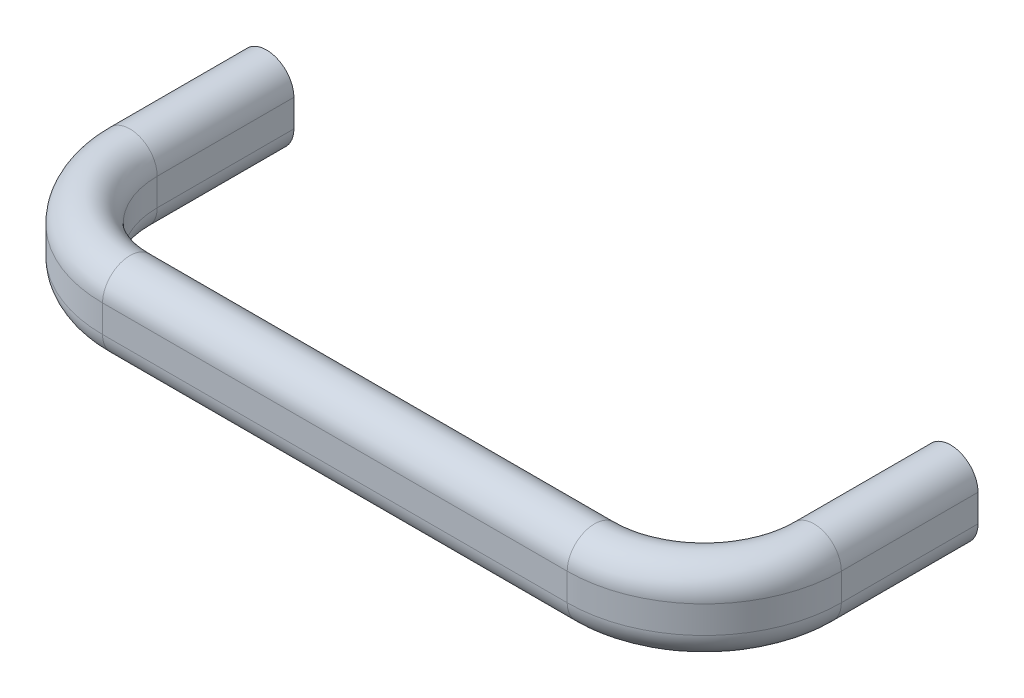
ISO-10303-21;
HEADER;
FILE_DESCRIPTION(('STEP AP214'),'2;1');
FILE_NAME('part.step','',(''),(''),'','','');
FILE_SCHEMA(('AUTOMOTIVE_DESIGN { 1 0 10303 214 1 1 1 1 }'));
ENDSEC;
DATA;
#1=APPLICATION_CONTEXT('core data for automotive mechanical design processes');
#2=APPLICATION_PROTOCOL_DEFINITION('international standard','automotive_design',2000,#1);
#3=PRODUCT_CONTEXT('',#1,'mechanical');
#4=PRODUCT('Part','Part','',(#3));
#5=PRODUCT_RELATED_PRODUCT_CATEGORY('part','',(#4));
#6=PRODUCT_DEFINITION_FORMATION('','',#4);
#7=PRODUCT_DEFINITION_CONTEXT('part definition',#1,'design');
#8=PRODUCT_DEFINITION('design','',#6,#7);
#9=PRODUCT_DEFINITION_SHAPE('','',#8);
#10=(LENGTH_UNIT() NAMED_UNIT(*) SI_UNIT(.MILLI.,.METRE.));
#11=(NAMED_UNIT(*) PLANE_ANGLE_UNIT() SI_UNIT($,.RADIAN.));
#12=(NAMED_UNIT(*) SI_UNIT($,.STERADIAN.) SOLID_ANGLE_UNIT());
#13=UNCERTAINTY_MEASURE_WITH_UNIT(LENGTH_MEASURE(1.E-05),#10,'distance_accuracy_value','');
#14=(GEOMETRIC_REPRESENTATION_CONTEXT(3) GLOBAL_UNCERTAINTY_ASSIGNED_CONTEXT((#13)) GLOBAL_UNIT_ASSIGNED_CONTEXT((#10,
#11,#12)) REPRESENTATION_CONTEXT('',''));
#15=CARTESIAN_POINT('',(0.,0.,0.));
#16=DIRECTION('',(0.,0.,1.));
#17=DIRECTION('',(1.,0.,0.));
#18=AXIS2_PLACEMENT_3D('',#15,#16,#17);
#19=CARTESIAN_POINT('',(-0.0622931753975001,1.96859057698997,0.));
#20=DIRECTION('',(0.,0.,-1.));
#21=DIRECTION('',(0.,1.,0.));
#22=AXIS2_PLACEMENT_3D('',#19,#20,#21);
#23=PLANE('',#22);
#24=CARTESIAN_POINT('',(-0.0622931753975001,1.96859057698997,0.));
#25=DIRECTION('',(0.,0.,-1.));
#26=DIRECTION('',(0.,1.,0.));
#27=AXIS2_PLACEMENT_3D('',#24,#25,#26);
#28=CIRCLE('',#27,4.);
#29=CARTESIAN_POINT('',(-4.0622931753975,1.96859057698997,0.));
#30=VERTEX_POINT('',#29);
#31=CARTESIAN_POINT('',(3.93770682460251,1.96859057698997,0.));
#32=VERTEX_POINT('',#31);
#33=EDGE_CURVE('E31',#30,#32,#28,.T.);
#34=ORIENTED_EDGE('',*,*,#33,.T.);
#35=DIRECTION('',(0.,-1.,0.));
#36=VECTOR('',#35,1.);
#37=CARTESIAN_POINT('',(3.93770682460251,1.96859057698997,0.));
#38=LINE('',#37,#36);
#39=CARTESIAN_POINT('',(3.93770682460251,-2.03140942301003,0.));
#40=VERTEX_POINT('',#39);
#41=EDGE_CURVE('E18',#32,#40,#38,.T.);
#42=ORIENTED_EDGE('',*,*,#41,.T.);
#43=CARTESIAN_POINT('',(-0.0622931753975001,-2.03140942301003,0.));
#44=DIRECTION('',(0.,0.,-1.));
#45=DIRECTION('',(0.,1.,0.));
#46=AXIS2_PLACEMENT_3D('',#43,#44,#45);
#47=CIRCLE('',#46,4.);
#48=CARTESIAN_POINT('',(-4.0622931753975,-2.03140942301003,0.));
#49=VERTEX_POINT('',#48);
#50=EDGE_CURVE('E39',#40,#49,#47,.T.);
#51=ORIENTED_EDGE('',*,*,#50,.T.);
#52=DIRECTION('',(0.,-1.,0.));
#53=VECTOR('',#52,1.);
#54=CARTESIAN_POINT('',(-4.0622931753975,1.96859057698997,0.));
#55=LINE('',#54,#53);
#56=EDGE_CURVE('E230',#30,#49,#55,.T.);
#57=ORIENTED_EDGE('',*,*,#56,.F.);
#58=EDGE_LOOP('',(#34,#42,#51,#57));
#59=FACE_BOUND('',#58,.T.);
#60=CARTESIAN_POINT('',(0.,0.,-2.25392079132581E-13));
#61=DIRECTION('',(0.,0.,-1.));
#62=DIRECTION('',(-1.,0.,0.));
#63=AXIS2_PLACEMENT_3D('',#60,#61,#62);
#64=CIRCLE('',#63,2.96700000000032);
#65=CARTESIAN_POINT('',(-2.96700000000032,0.,-2.26701545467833E-13));
#66=VERTEX_POINT('',#65);
#67=EDGE_CURVE('E542',#66,#66,#64,.T.);
#68=ORIENTED_EDGE('',*,*,#67,.F.);
#69=EDGE_LOOP('',(#68));
#70=FACE_BOUND('',#69,.T.);
#71=ADVANCED_FACE('F14',(#59,#70),#23,.T.);
#72=CARTESIAN_POINT('',(100.062293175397,1.96859057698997,0.));
#73=DIRECTION('',(0.,0.,1.));
#74=DIRECTION('',(0.,1.,0.));
#75=AXIS2_PLACEMENT_3D('',#72,#73,#74);
#76=PLANE('',#75);
#77=CARTESIAN_POINT('',(100.062293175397,1.96859057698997,0.));
#78=DIRECTION('',(0.,0.,1.));
#79=DIRECTION('',(0.,1.,0.));
#80=AXIS2_PLACEMENT_3D('',#77,#78,#79);
#81=CIRCLE('',#80,4.);
#82=CARTESIAN_POINT('',(104.062293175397,1.96859057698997,0.));
#83=VERTEX_POINT('',#82);
#84=CARTESIAN_POINT('',(96.0622931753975,1.96859057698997,0.));
#85=VERTEX_POINT('',#84);
#86=EDGE_CURVE('E107',#83,#85,#81,.T.);
#87=ORIENTED_EDGE('',*,*,#86,.F.);
#88=DIRECTION('',(0.,-1.,0.));
#89=VECTOR('',#88,1.);
#90=CARTESIAN_POINT('',(104.062293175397,1.96859057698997,0.));
#91=LINE('',#90,#89);
#92=CARTESIAN_POINT('',(104.062293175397,-2.03140942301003,0.));
#93=VERTEX_POINT('',#92);
#94=EDGE_CURVE('E136',#83,#93,#91,.T.);
#95=ORIENTED_EDGE('',*,*,#94,.T.);
#96=CARTESIAN_POINT('',(100.062293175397,-2.03140942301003,0.));
#97=DIRECTION('',(0.,0.,1.));
#98=DIRECTION('',(0.,1.,0.));
#99=AXIS2_PLACEMENT_3D('',#96,#97,#98);
#100=CIRCLE('',#99,4.);
#101=CARTESIAN_POINT('',(96.0622931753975,-2.03140942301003,0.));
#102=VERTEX_POINT('',#101);
#103=EDGE_CURVE('E134',#102,#93,#100,.T.);
#104=ORIENTED_EDGE('',*,*,#103,.F.);
#105=DIRECTION('',(0.,-1.,0.));
#106=VECTOR('',#105,1.);
#107=CARTESIAN_POINT('',(96.0622931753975,1.96859057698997,0.));
#108=LINE('',#107,#106);
#109=EDGE_CURVE('E119',#85,#102,#108,.T.);
#110=ORIENTED_EDGE('',*,*,#109,.F.);
#111=EDGE_LOOP('',(#87,#95,#104,#110));
#112=FACE_BOUND('',#111,.T.);
#113=CARTESIAN_POINT('',(100.,0.,-1.52603933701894E-13));
#114=DIRECTION('',(0.,0.,1.));
#115=DIRECTION('',(1.,0.,0.));
#116=AXIS2_PLACEMENT_3D('',#113,#114,#115);
#117=CIRCLE('',#116,2.96700000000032);
#118=CARTESIAN_POINT('',(102.967,0.,-1.49594151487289E-13));
#119=VERTEX_POINT('',#118);
#120=EDGE_CURVE('E120',#119,#119,#117,.T.);
#121=ORIENTED_EDGE('',*,*,#120,.T.);
#122=EDGE_LOOP('',(#121));
#123=FACE_BOUND('',#122,.T.);
#124=ADVANCED_FACE('F132',(#112,#123),#76,.F.);
#125=CARTESIAN_POINT('',(3.93770682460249,1.96859057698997,20.));
#126=DIRECTION('',(1.,0.,0.));
#127=DIRECTION('',(0.,1.,0.));
#128=AXIS2_PLACEMENT_3D('',#125,#126,#127);
#129=PLANE('',#128);
#130=DIRECTION('',(0.,-1.,0.));
#131=VECTOR('',#130,1.);
#132=CARTESIAN_POINT('',(3.93770682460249,1.96859057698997,20.));
#133=LINE('',#132,#131);
#134=CARTESIAN_POINT('',(3.93770682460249,1.96859057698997,20.));
#135=VERTEX_POINT('',#134);
#136=CARTESIAN_POINT('',(3.93770682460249,-2.03140942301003,20.));
#137=VERTEX_POINT('',#136);
#138=EDGE_CURVE('E204',#135,#137,#133,.T.);
#139=ORIENTED_EDGE('',*,*,#138,.T.);
#140=DIRECTION('',(0.,0.,-1.));
#141=VECTOR('',#140,1.);
#142=CARTESIAN_POINT('',(3.93770682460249,-2.03140942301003,20.));
#143=LINE('',#142,#141);
#144=EDGE_CURVE('E23',#137,#40,#143,.T.);
#145=ORIENTED_EDGE('',*,*,#144,.T.);
#146=ORIENTED_EDGE('',*,*,#41,.F.);
#147=DIRECTION('',(0.,0.,-1.));
#148=VECTOR('',#147,1.);
#149=CARTESIAN_POINT('',(3.93770682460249,1.96859057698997,20.));
#150=LINE('',#149,#148);
#151=EDGE_CURVE('E9',#135,#32,#150,.T.);
#152=ORIENTED_EDGE('',*,*,#151,.F.);
#153=EDGE_LOOP('',(#139,#145,#146,#152));
#154=FACE_BOUND('',#153,.T.);
#155=ADVANCED_FACE('F16',(#154),#129,.T.);
#156=CARTESIAN_POINT('',(-0.0622931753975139,-2.03140942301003,20.));
#157=DIRECTION('',(0.,0.,-1.));
#158=DIRECTION('',(0.,-1.,0.));
#159=AXIS2_PLACEMENT_3D('',#156,#157,#158);
#160=CYLINDRICAL_SURFACE('',#159,4.);
#161=CARTESIAN_POINT('',(-0.0622931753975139,-2.03140942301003,20.));
#162=DIRECTION('',(0.,0.,-1.));
#163=DIRECTION('',(0.,1.,0.));
#164=AXIS2_PLACEMENT_3D('',#161,#162,#163);
#165=CIRCLE('',#164,4.);
#166=CARTESIAN_POINT('',(-4.06229317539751,-2.03140942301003,20.));
#167=VERTEX_POINT('',#166);
#168=EDGE_CURVE('E217',#137,#167,#165,.T.);
#169=ORIENTED_EDGE('',*,*,#168,.T.);
#170=DIRECTION('',(0.,0.,-1.));
#171=VECTOR('',#170,1.);
#172=CARTESIAN_POINT('',(-4.06229317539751,-2.03140942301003,20.));
#173=LINE('',#172,#171);
#174=EDGE_CURVE('E225',#167,#49,#173,.T.);
#175=ORIENTED_EDGE('',*,*,#174,.T.);
#176=ORIENTED_EDGE('',*,*,#50,.F.);
#177=ORIENTED_EDGE('',*,*,#144,.F.);
#178=EDGE_LOOP('',(#169,#175,#176,#177));
#179=FACE_BOUND('',#178,.T.);
#180=ADVANCED_FACE('F235',(#179),#160,.T.);
#181=CARTESIAN_POINT('',(-4.06229317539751,1.96859057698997,20.));
#182=DIRECTION('',(1.,0.,0.));
#183=DIRECTION('',(0.,1.,0.));
#184=AXIS2_PLACEMENT_3D('',#181,#182,#183);
#185=PLANE('',#184);
#186=DIRECTION('',(0.,-1.,0.));
#187=VECTOR('',#186,1.);
#188=CARTESIAN_POINT('',(-4.06229317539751,1.96859057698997,20.));
#189=LINE('',#188,#187);
#190=CARTESIAN_POINT('',(-4.06229317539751,1.96859057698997,20.));
#191=VERTEX_POINT('',#190);
#192=EDGE_CURVE('E214',#191,#167,#189,.T.);
#193=ORIENTED_EDGE('',*,*,#192,.F.);
#194=DIRECTION('',(0.,0.,-1.));
#195=VECTOR('',#194,1.);
#196=CARTESIAN_POINT('',(-4.06229317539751,1.96859057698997,20.));
#197=LINE('',#196,#195);
#198=EDGE_CURVE('E222',#191,#30,#197,.T.);
#199=ORIENTED_EDGE('',*,*,#198,.T.);
#200=ORIENTED_EDGE('',*,*,#56,.T.);
#201=ORIENTED_EDGE('',*,*,#174,.F.);
#202=EDGE_LOOP('',(#193,#199,#200,#201));
#203=FACE_BOUND('',#202,.T.);
#204=ADVANCED_FACE('F292',(#203),#185,.F.);
#205=CARTESIAN_POINT('',(-0.0622931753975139,1.96859057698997,20.));
#206=DIRECTION('',(0.,0.,-1.));
#207=DIRECTION('',(0.,-1.,0.));
#208=AXIS2_PLACEMENT_3D('',#205,#206,#207);
#209=CYLINDRICAL_SURFACE('',#208,4.);
#210=CARTESIAN_POINT('',(-0.0622931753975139,1.96859057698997,20.));
#211=DIRECTION('',(0.,0.,-1.));
#212=DIRECTION('',(0.,1.,0.));
#213=AXIS2_PLACEMENT_3D('',#210,#211,#212);
#214=CIRCLE('',#213,4.);
#215=EDGE_CURVE('E190',#191,#135,#214,.T.);
#216=ORIENTED_EDGE('',*,*,#215,.T.);
#217=ORIENTED_EDGE('',*,*,#151,.T.);
#218=ORIENTED_EDGE('',*,*,#33,.F.);
#219=ORIENTED_EDGE('',*,*,#198,.F.);
#220=EDGE_LOOP('',(#216,#217,#218,#219));
#221=FACE_BOUND('',#220,.T.);
#222=ADVANCED_FACE('F283',(#221),#209,.T.);
#223=CARTESIAN_POINT('',(16.,0.,20.));
#224=DIRECTION('',(0.,-1.,0.));
#225=DIRECTION('',(1.,0.,0.));
#226=AXIS2_PLACEMENT_3D('',#223,#224,#225);
#227=CYLINDRICAL_SURFACE('',#226,12.0622931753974);
#228=DIRECTION('',(0.,-1.,0.));
#229=VECTOR('',#228,1.);
#230=CARTESIAN_POINT('',(16.,1.96859057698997,32.0622931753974));
#231=LINE('',#230,#229);
#232=CARTESIAN_POINT('',(16.,1.96859057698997,32.0622931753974));
#233=VERTEX_POINT('',#232);
#234=CARTESIAN_POINT('',(16.,-2.03140942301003,32.0622931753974));
#235=VERTEX_POINT('',#234);
#236=EDGE_CURVE('E181',#233,#235,#231,.T.);
#237=ORIENTED_EDGE('',*,*,#236,.T.);
#238=CARTESIAN_POINT('',(16.,-2.03140942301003,20.));
#239=DIRECTION('',(0.,-1.,0.));
#240=DIRECTION('',(1.,0.,0.));
#241=AXIS2_PLACEMENT_3D('',#238,#239,#240);
#242=CIRCLE('',#241,12.0622931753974);
#243=EDGE_CURVE('E207',#235,#137,#242,.T.);
#244=ORIENTED_EDGE('',*,*,#243,.T.);
#245=ORIENTED_EDGE('',*,*,#138,.F.);
#246=CARTESIAN_POINT('',(16.,1.96859057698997,20.));
#247=DIRECTION('',(0.,-1.,0.));
#248=DIRECTION('',(1.,0.,0.));
#249=AXIS2_PLACEMENT_3D('',#246,#247,#248);
#250=CIRCLE('',#249,12.0622931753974);
#251=EDGE_CURVE('E210',#233,#135,#250,.T.);
#252=ORIENTED_EDGE('',*,*,#251,.F.);
#253=EDGE_LOOP('',(#237,#244,#245,#252));
#254=FACE_BOUND('',#253,.T.);
#255=ADVANCED_FACE('F281',(#254),#227,.F.);
#256=CARTESIAN_POINT('',(16.,-2.03140942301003,20.));
#257=DIRECTION('',(0.,-1.,0.));
#258=DIRECTION('',(1.,0.,0.));
#259=AXIS2_PLACEMENT_3D('',#256,#257,#258);
#260=TOROIDAL_SURFACE('',#259,16.0622931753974,4.);
#261=CARTESIAN_POINT('',(16.,-2.03140942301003,36.0622931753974));
#262=DIRECTION('',(-1.,0.,0.));
#263=DIRECTION('',(0.,1.,0.));
#264=AXIS2_PLACEMENT_3D('',#261,#262,#263);
#265=CIRCLE('',#264,4.);
#266=CARTESIAN_POINT('',(16.,-2.03140942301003,40.0622931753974));
#267=VERTEX_POINT('',#266);
#268=EDGE_CURVE('E195',#235,#267,#265,.T.);
#269=ORIENTED_EDGE('',*,*,#268,.T.);
#270=CARTESIAN_POINT('',(16.,-2.03140942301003,20.));
#271=DIRECTION('',(0.,-1.,0.));
#272=DIRECTION('',(1.,0.,0.));
#273=AXIS2_PLACEMENT_3D('',#270,#271,#272);
#274=CIRCLE('',#273,20.0622931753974);
#275=EDGE_CURVE('E203',#267,#167,#274,.T.);
#276=ORIENTED_EDGE('',*,*,#275,.T.);
#277=ORIENTED_EDGE('',*,*,#168,.F.);
#278=ORIENTED_EDGE('',*,*,#243,.F.);
#279=EDGE_LOOP('',(#269,#276,#277,#278));
#280=FACE_BOUND('',#279,.T.);
#281=ADVANCED_FACE('F244',(#280),#260,.T.);
#282=CARTESIAN_POINT('',(16.,0.,20.));
#283=DIRECTION('',(0.,-1.,0.));
#284=DIRECTION('',(1.,0.,0.));
#285=AXIS2_PLACEMENT_3D('',#282,#283,#284);
#286=CYLINDRICAL_SURFACE('',#285,20.0622931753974);
#287=DIRECTION('',(0.,-1.,0.));
#288=VECTOR('',#287,1.);
#289=CARTESIAN_POINT('',(16.,1.96859057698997,40.0622931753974));
#290=LINE('',#289,#288);
#291=CARTESIAN_POINT('',(16.,1.96859057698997,40.0622931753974));
#292=VERTEX_POINT('',#291);
#293=EDGE_CURVE('E192',#292,#267,#290,.T.);
#294=ORIENTED_EDGE('',*,*,#293,.F.);
#295=CARTESIAN_POINT('',(16.,1.96859057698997,20.));
#296=DIRECTION('',(0.,-1.,0.));
#297=DIRECTION('',(1.,0.,0.));
#298=AXIS2_PLACEMENT_3D('',#295,#296,#297);
#299=CIRCLE('',#298,20.0622931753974);
#300=EDGE_CURVE('E200',#292,#191,#299,.T.);
#301=ORIENTED_EDGE('',*,*,#300,.T.);
#302=ORIENTED_EDGE('',*,*,#192,.T.);
#303=ORIENTED_EDGE('',*,*,#275,.F.);
#304=EDGE_LOOP('',(#294,#301,#302,#303));
#305=FACE_BOUND('',#304,.T.);
#306=ADVANCED_FACE('F241',(#305),#286,.T.);
#307=CARTESIAN_POINT('',(16.,1.96859057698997,20.));
#308=DIRECTION('',(0.,-1.,0.));
#309=DIRECTION('',(1.,0.,0.));
#310=AXIS2_PLACEMENT_3D('',#307,#308,#309);
#311=TOROIDAL_SURFACE('',#310,16.0622931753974,4.);
#312=CARTESIAN_POINT('',(16.,1.96859057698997,36.0622931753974));
#313=DIRECTION('',(-1.,0.,0.));
#314=DIRECTION('',(0.,1.,0.));
#315=AXIS2_PLACEMENT_3D('',#312,#313,#314);
#316=CIRCLE('',#315,4.);
#317=EDGE_CURVE('E167',#292,#233,#316,.T.);
#318=ORIENTED_EDGE('',*,*,#317,.T.);
#319=ORIENTED_EDGE('',*,*,#251,.T.);
#320=ORIENTED_EDGE('',*,*,#215,.F.);
#321=ORIENTED_EDGE('',*,*,#300,.F.);
#322=EDGE_LOOP('',(#318,#319,#320,#321));
#323=FACE_BOUND('',#322,.T.);
#324=ADVANCED_FACE('F279',(#323),#311,.T.);
#325=CARTESIAN_POINT('',(84.,1.96859057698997,32.0622931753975));
#326=DIRECTION('',(0.,0.,-1.));
#327=DIRECTION('',(-1.,0.,0.));
#328=AXIS2_PLACEMENT_3D('',#325,#326,#327);
#329=PLANE('',#328);
#330=DIRECTION('',(0.,-1.,0.));
#331=VECTOR('',#330,1.);
#332=CARTESIAN_POINT('',(84.,1.96859057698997,32.0622931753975));
#333=LINE('',#332,#331);
#334=CARTESIAN_POINT('',(84.,1.96859057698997,32.0622931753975));
#335=VERTEX_POINT('',#334);
#336=CARTESIAN_POINT('',(84.,-2.03140942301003,32.0622931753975));
#337=VERTEX_POINT('',#336);
#338=EDGE_CURVE('E158',#335,#337,#333,.T.);
#339=ORIENTED_EDGE('',*,*,#338,.T.);
#340=DIRECTION('',(-1.,0.,0.));
#341=VECTOR('',#340,1.);
#342=CARTESIAN_POINT('',(84.,-2.03140942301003,32.0622931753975));
#343=LINE('',#342,#341);
#344=EDGE_CURVE('E184',#337,#235,#343,.T.);
#345=ORIENTED_EDGE('',*,*,#344,.T.);
#346=ORIENTED_EDGE('',*,*,#236,.F.);
#347=DIRECTION('',(-1.,0.,0.));
#348=VECTOR('',#347,1.);
#349=CARTESIAN_POINT('',(84.,1.96859057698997,32.0622931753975));
#350=LINE('',#349,#348);
#351=EDGE_CURVE('E187',#335,#233,#350,.T.);
#352=ORIENTED_EDGE('',*,*,#351,.F.);
#353=EDGE_LOOP('',(#339,#345,#346,#352));
#354=FACE_BOUND('',#353,.T.);
#355=ADVANCED_FACE('F273',(#354),#329,.T.);
#356=CARTESIAN_POINT('',(84.,-2.03140942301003,36.0622931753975));
#357=DIRECTION('',(-1.,0.,0.));
#358=DIRECTION('',(0.,0.,1.));
#359=AXIS2_PLACEMENT_3D('',#356,#357,#358);
#360=CYLINDRICAL_SURFACE('',#359,4.);
#361=CARTESIAN_POINT('',(84.,-2.03140942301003,36.0622931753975));
#362=DIRECTION('',(-1.,0.,0.));
#363=DIRECTION('',(0.,1.,0.));
#364=AXIS2_PLACEMENT_3D('',#361,#362,#363);
#365=CIRCLE('',#364,4.);
#366=CARTESIAN_POINT('',(84.,-2.03140942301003,40.0622931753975));
#367=VERTEX_POINT('',#366);
#368=EDGE_CURVE('E172',#337,#367,#365,.T.);
#369=ORIENTED_EDGE('',*,*,#368,.T.);
#370=DIRECTION('',(-1.,0.,0.));
#371=VECTOR('',#370,1.);
#372=CARTESIAN_POINT('',(84.,-2.03140942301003,40.0622931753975));
#373=LINE('',#372,#371);
#374=EDGE_CURVE('E180',#367,#267,#373,.T.);
#375=ORIENTED_EDGE('',*,*,#374,.T.);
#376=ORIENTED_EDGE('',*,*,#268,.F.);
#377=ORIENTED_EDGE('',*,*,#344,.F.);
#378=EDGE_LOOP('',(#369,#375,#376,#377));
#379=FACE_BOUND('',#378,.T.);
#380=ADVANCED_FACE('F251',(#379),#360,.T.);
#381=CARTESIAN_POINT('',(84.,1.96859057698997,40.0622931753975));
#382=DIRECTION('',(0.,0.,-1.));
#383=DIRECTION('',(-1.,0.,0.));
#384=AXIS2_PLACEMENT_3D('',#381,#382,#383);
#385=PLANE('',#384);
#386=DIRECTION('',(0.,-1.,0.));
#387=VECTOR('',#386,1.);
#388=CARTESIAN_POINT('',(84.,1.96859057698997,40.0622931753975));
#389=LINE('',#388,#387);
#390=CARTESIAN_POINT('',(84.,1.96859057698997,40.0622931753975));
#391=VERTEX_POINT('',#390);
#392=EDGE_CURVE('E169',#391,#367,#389,.T.);
#393=ORIENTED_EDGE('',*,*,#392,.F.);
#394=DIRECTION('',(-1.,0.,0.));
#395=VECTOR('',#394,1.);
#396=CARTESIAN_POINT('',(84.,1.96859057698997,40.0622931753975));
#397=LINE('',#396,#395);
#398=EDGE_CURVE('E177',#391,#292,#397,.T.);
#399=ORIENTED_EDGE('',*,*,#398,.T.);
#400=ORIENTED_EDGE('',*,*,#293,.T.);
#401=ORIENTED_EDGE('',*,*,#374,.F.);
#402=EDGE_LOOP('',(#393,#399,#400,#401));
#403=FACE_BOUND('',#402,.T.);
#404=ADVANCED_FACE('F249',(#403),#385,.F.);
#405=CARTESIAN_POINT('',(84.,1.96859057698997,36.0622931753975));
#406=DIRECTION('',(-1.,0.,0.));
#407=DIRECTION('',(0.,0.,1.));
#408=AXIS2_PLACEMENT_3D('',#405,#406,#407);
#409=CYLINDRICAL_SURFACE('',#408,4.);
#410=CARTESIAN_POINT('',(84.,1.96859057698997,36.0622931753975));
#411=DIRECTION('',(-1.,0.,0.));
#412=DIRECTION('',(0.,1.,0.));
#413=AXIS2_PLACEMENT_3D('',#410,#411,#412);
#414=CIRCLE('',#413,4.);
#415=EDGE_CURVE('E129',#391,#335,#414,.T.);
#416=ORIENTED_EDGE('',*,*,#415,.T.);
#417=ORIENTED_EDGE('',*,*,#351,.T.);
#418=ORIENTED_EDGE('',*,*,#317,.F.);
#419=ORIENTED_EDGE('',*,*,#398,.F.);
#420=EDGE_LOOP('',(#416,#417,#418,#419));
#421=FACE_BOUND('',#420,.T.);
#422=ADVANCED_FACE('F276',(#421),#409,.T.);
#423=CARTESIAN_POINT('',(84.,0.,20.));
#424=DIRECTION('',(0.,-1.,0.));
#425=DIRECTION('',(1.,0.,0.));
#426=AXIS2_PLACEMENT_3D('',#423,#424,#425);
#427=CYLINDRICAL_SURFACE('',#426,12.0622931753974);
#428=DIRECTION('',(0.,-1.,0.));
#429=VECTOR('',#428,1.);
#430=CARTESIAN_POINT('',(96.0622931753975,1.96859057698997,20.));
#431=LINE('',#430,#429);
#432=CARTESIAN_POINT('',(96.0622931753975,1.96859057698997,20.));
#433=VERTEX_POINT('',#432);
#434=CARTESIAN_POINT('',(96.0622931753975,-2.03140942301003,20.));
#435=VERTEX_POINT('',#434);
#436=EDGE_CURVE('E128',#433,#435,#431,.T.);
#437=ORIENTED_EDGE('',*,*,#436,.T.);
#438=CARTESIAN_POINT('',(84.,-2.03140942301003,20.));
#439=DIRECTION('',(0.,-1.,0.));
#440=DIRECTION('',(1.,0.,0.));
#441=AXIS2_PLACEMENT_3D('',#438,#439,#440);
#442=CIRCLE('',#441,12.0622931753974);
#443=EDGE_CURVE('E161',#435,#337,#442,.T.);
#444=ORIENTED_EDGE('',*,*,#443,.T.);
#445=ORIENTED_EDGE('',*,*,#338,.F.);
#446=CARTESIAN_POINT('',(84.,1.96859057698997,20.));
#447=DIRECTION('',(0.,-1.,0.));
#448=DIRECTION('',(1.,0.,0.));
#449=AXIS2_PLACEMENT_3D('',#446,#447,#448);
#450=CIRCLE('',#449,12.0622931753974);
#451=EDGE_CURVE('E164',#433,#335,#450,.T.);
#452=ORIENTED_EDGE('',*,*,#451,.F.);
#453=EDGE_LOOP('',(#437,#444,#445,#452));
#454=FACE_BOUND('',#453,.T.);
#455=ADVANCED_FACE('F270',(#454),#427,.F.);
#456=CARTESIAN_POINT('',(84.,-2.03140942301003,20.));
#457=DIRECTION('',(0.,-1.,0.));
#458=DIRECTION('',(1.,0.,0.));
#459=AXIS2_PLACEMENT_3D('',#456,#457,#458);
#460=TOROIDAL_SURFACE('',#459,16.0622931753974,4.);
#461=CARTESIAN_POINT('',(100.062293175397,-2.03140942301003,20.));
#462=DIRECTION('',(0.,0.,1.));
#463=DIRECTION('',(0.,1.,0.));
#464=AXIS2_PLACEMENT_3D('',#461,#462,#463);
#465=CIRCLE('',#464,4.);
#466=CARTESIAN_POINT('',(104.062293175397,-2.03140942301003,20.));
#467=VERTEX_POINT('',#466);
#468=EDGE_CURVE('E144',#435,#467,#465,.T.);
#469=ORIENTED_EDGE('',*,*,#468,.T.);
#470=CARTESIAN_POINT('',(84.,-2.03140942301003,20.));
#471=DIRECTION('',(0.,-1.,0.));
#472=DIRECTION('',(1.,0.,0.));
#473=AXIS2_PLACEMENT_3D('',#470,#471,#472);
#474=CIRCLE('',#473,20.0622931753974);
#475=EDGE_CURVE('E157',#467,#367,#474,.T.);
#476=ORIENTED_EDGE('',*,*,#475,.T.);
#477=ORIENTED_EDGE('',*,*,#368,.F.);
#478=ORIENTED_EDGE('',*,*,#443,.F.);
#479=EDGE_LOOP('',(#469,#476,#477,#478));
#480=FACE_BOUND('',#479,.T.);
#481=ADVANCED_FACE('F259',(#480),#460,.T.);
#482=CARTESIAN_POINT('',(84.,0.,20.));
#483=DIRECTION('',(0.,-1.,0.));
#484=DIRECTION('',(1.,0.,0.));
#485=AXIS2_PLACEMENT_3D('',#482,#483,#484);
#486=CYLINDRICAL_SURFACE('',#485,20.0622931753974);
#487=DIRECTION('',(0.,-1.,0.));
#488=VECTOR('',#487,1.);
#489=CARTESIAN_POINT('',(104.062293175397,1.96859057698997,20.));
#490=LINE('',#489,#488);
#491=CARTESIAN_POINT('',(104.062293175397,1.96859057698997,20.));
#492=VERTEX_POINT('',#491);
#493=EDGE_CURVE('E146',#492,#467,#490,.T.);
#494=ORIENTED_EDGE('',*,*,#493,.F.);
#495=CARTESIAN_POINT('',(84.,1.96859057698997,20.));
#496=DIRECTION('',(0.,-1.,0.));
#497=DIRECTION('',(1.,0.,0.));
#498=AXIS2_PLACEMENT_3D('',#495,#496,#497);
#499=CIRCLE('',#498,20.0622931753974);
#500=EDGE_CURVE('E154',#492,#391,#499,.T.);
#501=ORIENTED_EDGE('',*,*,#500,.T.);
#502=ORIENTED_EDGE('',*,*,#392,.T.);
#503=ORIENTED_EDGE('',*,*,#475,.F.);
#504=EDGE_LOOP('',(#494,#501,#502,#503));
#505=FACE_BOUND('',#504,.T.);
#506=ADVANCED_FACE('F256',(#505),#486,.T.);
#507=CARTESIAN_POINT('',(84.,1.96859057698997,20.));
#508=DIRECTION('',(0.,-1.,0.));
#509=DIRECTION('',(1.,0.,0.));
#510=AXIS2_PLACEMENT_3D('',#507,#508,#509);
#511=TOROIDAL_SURFACE('',#510,16.0622931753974,4.);
#512=CARTESIAN_POINT('',(100.062293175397,1.96859057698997,20.));
#513=DIRECTION('',(0.,0.,1.));
#514=DIRECTION('',(0.,1.,0.));
#515=AXIS2_PLACEMENT_3D('',#512,#513,#514);
#516=CIRCLE('',#515,4.);
#517=EDGE_CURVE('E141',#492,#433,#516,.T.);
#518=ORIENTED_EDGE('',*,*,#517,.T.);
#519=ORIENTED_EDGE('',*,*,#451,.T.);
#520=ORIENTED_EDGE('',*,*,#415,.F.);
#521=ORIENTED_EDGE('',*,*,#500,.F.);
#522=EDGE_LOOP('',(#518,#519,#520,#521));
#523=FACE_BOUND('',#522,.T.);
#524=ADVANCED_FACE('F267',(#523),#511,.T.);
#525=CARTESIAN_POINT('',(100.062293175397,1.96859057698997,20.));
#526=DIRECTION('',(0.,0.,-1.));
#527=DIRECTION('',(0.,-1.,0.));
#528=AXIS2_PLACEMENT_3D('',#525,#526,#527);
#529=CYLINDRICAL_SURFACE('',#528,4.);
#530=DIRECTION('',(0.,0.,-1.));
#531=VECTOR('',#530,1.);
#532=CARTESIAN_POINT('',(96.0622931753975,1.96859057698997,20.));
#533=LINE('',#532,#531);
#534=EDGE_CURVE('E111',#433,#85,#533,.T.);
#535=ORIENTED_EDGE('',*,*,#534,.F.);
#536=ORIENTED_EDGE('',*,*,#517,.F.);
#537=DIRECTION('',(0.,0.,-1.));
#538=VECTOR('',#537,1.);
#539=CARTESIAN_POINT('',(104.062293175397,1.96859057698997,20.));
#540=LINE('',#539,#538);
#541=EDGE_CURVE('E114',#492,#83,#540,.T.);
#542=ORIENTED_EDGE('',*,*,#541,.T.);
#543=ORIENTED_EDGE('',*,*,#86,.T.);
#544=EDGE_LOOP('',(#535,#536,#542,#543));
#545=FACE_BOUND('',#544,.T.);
#546=ADVANCED_FACE('F109',(#545),#529,.T.);
#547=CARTESIAN_POINT('',(96.0622931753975,1.96859057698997,20.));
#548=DIRECTION('',(1.,0.,0.));
#549=DIRECTION('',(0.,1.,0.));
#550=AXIS2_PLACEMENT_3D('',#547,#548,#549);
#551=PLANE('',#550);
#552=DIRECTION('',(0.,0.,-1.));
#553=VECTOR('',#552,1.);
#554=CARTESIAN_POINT('',(96.0622931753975,-2.03140942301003,20.));
#555=LINE('',#554,#553);
#556=EDGE_CURVE('E130',#435,#102,#555,.T.);
#557=ORIENTED_EDGE('',*,*,#556,.F.);
#558=ORIENTED_EDGE('',*,*,#436,.F.);
#559=ORIENTED_EDGE('',*,*,#534,.T.);
#560=ORIENTED_EDGE('',*,*,#109,.T.);
#561=EDGE_LOOP('',(#557,#558,#559,#560));
#562=FACE_BOUND('',#561,.T.);
#563=ADVANCED_FACE('F125',(#562),#551,.F.);
#564=CARTESIAN_POINT('',(100.062293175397,-2.03140942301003,20.));
#565=DIRECTION('',(0.,0.,-1.));
#566=DIRECTION('',(0.,-1.,0.));
#567=AXIS2_PLACEMENT_3D('',#564,#565,#566);
#568=CYLINDRICAL_SURFACE('',#567,4.);
#569=DIRECTION('',(0.,0.,-1.));
#570=VECTOR('',#569,1.);
#571=CARTESIAN_POINT('',(104.062293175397,-2.03140942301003,20.));
#572=LINE('',#571,#570);
#573=EDGE_CURVE('E150',#467,#93,#572,.T.);
#574=ORIENTED_EDGE('',*,*,#573,.F.);
#575=ORIENTED_EDGE('',*,*,#468,.F.);
#576=ORIENTED_EDGE('',*,*,#556,.T.);
#577=ORIENTED_EDGE('',*,*,#103,.T.);
#578=EDGE_LOOP('',(#574,#575,#576,#577));
#579=FACE_BOUND('',#578,.T.);
#580=ADVANCED_FACE('F262',(#579),#568,.T.);
#581=CARTESIAN_POINT('',(104.062293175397,1.96859057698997,20.));
#582=DIRECTION('',(1.,0.,0.));
#583=DIRECTION('',(0.,1.,0.));
#584=AXIS2_PLACEMENT_3D('',#581,#582,#583);
#585=PLANE('',#584);
#586=ORIENTED_EDGE('',*,*,#493,.T.);
#587=ORIENTED_EDGE('',*,*,#573,.T.);
#588=ORIENTED_EDGE('',*,*,#94,.F.);
#589=ORIENTED_EDGE('',*,*,#541,.F.);
#590=EDGE_LOOP('',(#586,#587,#588,#589));
#591=FACE_BOUND('',#590,.T.);
#592=ADVANCED_FACE('F264',(#591),#585,.T.);
#593=CARTESIAN_POINT('',(100.,0.,-1.52603933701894E-13));
#594=DIRECTION('',(0.,0.,-1.));
#595=DIRECTION('',(-1.,0.,0.));
#596=AXIS2_PLACEMENT_3D('',#593,#594,#595);
#597=CONICAL_SURFACE('',#596,2.96700000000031,0.785398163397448);
#598=CARTESIAN_POINT('',(100.,0.,0.467000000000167));
#599=DIRECTION('',(0.,0.,-1.));
#600=DIRECTION('',(-1.,0.,0.));
#601=AXIS2_PLACEMENT_3D('',#598,#599,#600);
#602=CIRCLE('',#601,2.5);
#603=CARTESIAN_POINT('',(97.5,0.,0.467000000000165));
#604=VERTEX_POINT('',#603);
#605=EDGE_CURVE('E539',#604,#604,#602,.T.);
#606=ORIENTED_EDGE('',*,*,#605,.F.);
#607=EDGE_LOOP('',(#606));
#608=FACE_BOUND('',#607,.T.);
#609=ORIENTED_EDGE('',*,*,#120,.F.);
#610=EDGE_LOOP('',(#609));
#611=FACE_BOUND('',#610,.T.);
#612=ADVANCED_FACE('F306',(#608,#611),#597,.F.);
#613=CARTESIAN_POINT('',(0.,0.,-2.25392079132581E-13));
#614=DIRECTION('',(0.,0.,-1.));
#615=DIRECTION('',(1.,0.,0.));
#616=AXIS2_PLACEMENT_3D('',#613,#614,#615);
#617=CONICAL_SURFACE('',#616,2.96700000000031,0.785398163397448);
#618=CARTESIAN_POINT('',(0.,0.,0.467000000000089));
#619=DIRECTION('',(0.,0.,-1.));
#620=DIRECTION('',(-1.,0.,0.));
#621=AXIS2_PLACEMENT_3D('',#618,#619,#620);
#622=CIRCLE('',#621,2.5);
#623=CARTESIAN_POINT('',(-2.5,0.,0.467000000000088));
#624=VERTEX_POINT('',#623);
#625=EDGE_CURVE('E531',#624,#624,#622,.T.);
#626=ORIENTED_EDGE('',*,*,#625,.F.);
#627=EDGE_LOOP('',(#626));
#628=FACE_BOUND('',#627,.T.);
#629=ORIENTED_EDGE('',*,*,#67,.T.);
#630=EDGE_LOOP('',(#629));
#631=FACE_BOUND('',#630,.T.);
#632=ADVANCED_FACE('F414',(#628,#631),#617,.F.);
#633=CARTESIAN_POINT('',(100.,0.,10.));
#634=DIRECTION('',(0.,0.,-1.));
#635=DIRECTION('',(-1.,0.,0.));
#636=AXIS2_PLACEMENT_3D('',#633,#634,#635);
#637=CYLINDRICAL_SURFACE('',#636,2.5);
#638=ORIENTED_EDGE('',*,*,#605,.T.);
#639=EDGE_LOOP('',(#638));
#640=FACE_BOUND('',#639,.T.);
#641=CARTESIAN_POINT('',(100.,0.,10.));
#642=DIRECTION('',(0.,0.,-1.));
#643=DIRECTION('',(-1.,0.,0.));
#644=AXIS2_PLACEMENT_3D('',#641,#642,#643);
#645=CIRCLE('',#644,2.5);
#646=CARTESIAN_POINT('',(97.5,0.,10.));
#647=VERTEX_POINT('',#646);
#648=EDGE_CURVE('E534',#647,#647,#645,.T.);
#649=ORIENTED_EDGE('',*,*,#648,.F.);
#650=EDGE_LOOP('',(#649));
#651=FACE_BOUND('',#650,.T.);
#652=ADVANCED_FACE('F422',(#640,#651),#637,.F.);
#653=CARTESIAN_POINT('',(100.,0.,10.));
#654=DIRECTION('',(0.,0.,-1.));
#655=DIRECTION('',(-1.,0.,0.));
#656=AXIS2_PLACEMENT_3D('',#653,#654,#655);
#657=PLANE('',#656);
#658=ORIENTED_EDGE('',*,*,#648,.T.);
#659=EDGE_LOOP('',(#658));
#660=FACE_BOUND('',#659,.T.);
#661=ADVANCED_FACE('F431',(#660),#657,.T.);
#662=CARTESIAN_POINT('',(0.,0.,10.));
#663=DIRECTION('',(0.,0.,-1.));
#664=DIRECTION('',(-1.,0.,0.));
#665=AXIS2_PLACEMENT_3D('',#662,#663,#664);
#666=CYLINDRICAL_SURFACE('',#665,2.5);
#667=ORIENTED_EDGE('',*,*,#625,.T.);
#668=EDGE_LOOP('',(#667));
#669=FACE_BOUND('',#668,.T.);
#670=CARTESIAN_POINT('',(0.,0.,10.));
#671=DIRECTION('',(0.,0.,-1.));
#672=DIRECTION('',(-1.,0.,0.));
#673=AXIS2_PLACEMENT_3D('',#670,#671,#672);
#674=CIRCLE('',#673,2.5);
#675=CARTESIAN_POINT('',(-2.5,0.,10.));
#676=VERTEX_POINT('',#675);
#677=EDGE_CURVE('E529',#676,#676,#674,.T.);
#678=ORIENTED_EDGE('',*,*,#677,.F.);
#679=EDGE_LOOP('',(#678));
#680=FACE_BOUND('',#679,.T.);
#681=ADVANCED_FACE('F440',(#669,#680),#666,.F.);
#682=CARTESIAN_POINT('',(0.,0.,10.));
#683=DIRECTION('',(0.,0.,-1.));
#684=DIRECTION('',(-1.,0.,0.));
#685=AXIS2_PLACEMENT_3D('',#682,#683,#684);
#686=PLANE('',#685);
#687=ORIENTED_EDGE('',*,*,#677,.T.);
#688=EDGE_LOOP('',(#687));
#689=FACE_BOUND('',#688,.T.);
#690=ADVANCED_FACE('F449',(#689),#686,.T.);
#691=CLOSED_SHELL('',(#71,#124,#155,#180,#204,#222,#255,#281,#306,#324,#355,#380,#404,#422,#455,
#481,#506,#524,#546,#563,#580,#592,#612,#632,#652,#661,#681,#690));
#692=MANIFOLD_SOLID_BREP('B1',#691);
#693=ADVANCED_BREP_SHAPE_REPRESENTATION('',(#18,#692),#14);
#694=SHAPE_DEFINITION_REPRESENTATION(#9,#693);
ENDSEC;
END-ISO-10303-21;
